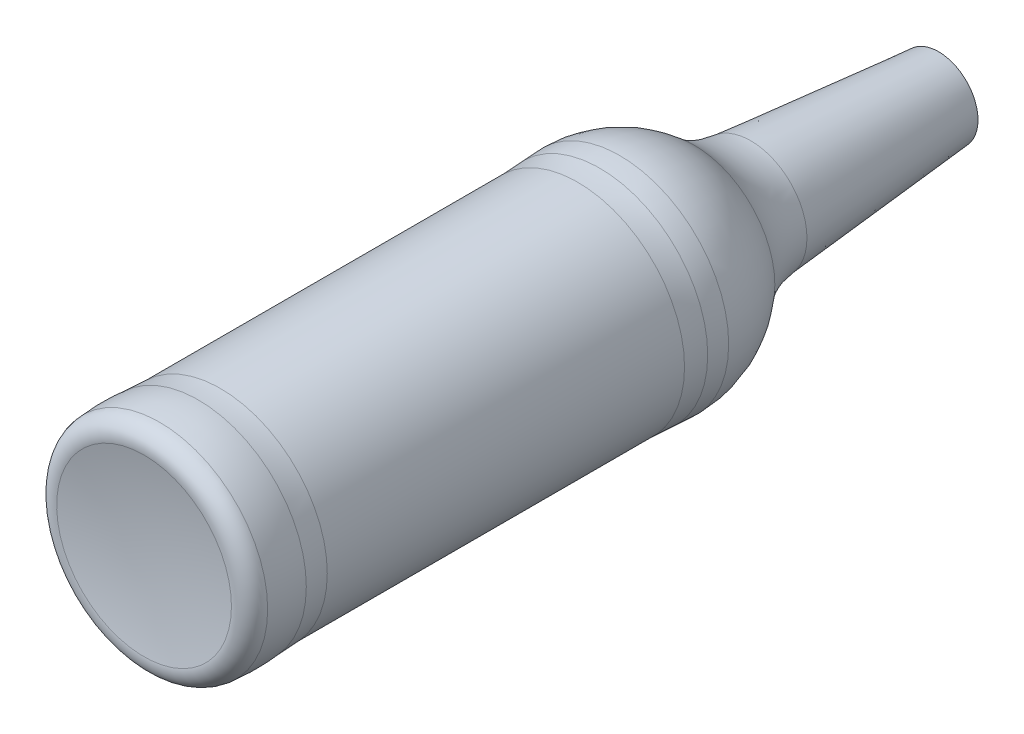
ISO-10303-21;
HEADER;
FILE_DESCRIPTION(('STEP AP214'),'2;1');
FILE_NAME('part.step','',(''),(''),'','','');
FILE_SCHEMA(('AUTOMOTIVE_DESIGN { 1 0 10303 214 1 1 1 1 }'));
ENDSEC;
DATA;
#1=APPLICATION_CONTEXT('core data for automotive mechanical design processes');
#2=APPLICATION_PROTOCOL_DEFINITION('international standard','automotive_design',2000,#1);
#3=PRODUCT_CONTEXT('',#1,'mechanical');
#4=PRODUCT('Part','Part','',(#3));
#5=PRODUCT_RELATED_PRODUCT_CATEGORY('part','',(#4));
#6=PRODUCT_DEFINITION_FORMATION('','',#4);
#7=PRODUCT_DEFINITION_CONTEXT('part definition',#1,'design');
#8=PRODUCT_DEFINITION('design','',#6,#7);
#9=PRODUCT_DEFINITION_SHAPE('','',#8);
#10=(LENGTH_UNIT() NAMED_UNIT(*) SI_UNIT(.MILLI.,.METRE.));
#11=(NAMED_UNIT(*) PLANE_ANGLE_UNIT() SI_UNIT($,.RADIAN.));
#12=(NAMED_UNIT(*) SI_UNIT($,.STERADIAN.) SOLID_ANGLE_UNIT());
#13=UNCERTAINTY_MEASURE_WITH_UNIT(LENGTH_MEASURE(1.E-05),#10,'distance_accuracy_value','');
#14=(GEOMETRIC_REPRESENTATION_CONTEXT(3) GLOBAL_UNCERTAINTY_ASSIGNED_CONTEXT((#13)) GLOBAL_UNIT_ASSIGNED_CONTEXT((#10,
#11,#12)) REPRESENTATION_CONTEXT('',''));
#15=CARTESIAN_POINT('',(0.,0.,0.));
#16=DIRECTION('',(0.,0.,1.));
#17=DIRECTION('',(1.,0.,0.));
#18=AXIS2_PLACEMENT_3D('',#15,#16,#17);
#19=CARTESIAN_POINT('',(0.,0.,399.211089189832));
#20=DIRECTION('',(0.,0.,1.));
#21=DIRECTION('',(0.,1.,0.));
#22=AXIS2_PLACEMENT_3D('',#19,#20,#21);
#23=SPHERICAL_SURFACE('',#22,135.711089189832);
#24=CARTESIAN_POINT('',(0.,0.,265.813116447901));
#25=DIRECTION('',(0.,0.,1.));
#26=DIRECTION('',(1.,0.,0.));
#27=AXIS2_PLACEMENT_3D('',#24,#25,#26);
#28=CIRCLE('',#27,24.9495610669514);
#29=CARTESIAN_POINT('',(24.9495610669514,0.,265.813116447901));
#30=VERTEX_POINT('',#29);
#31=EDGE_CURVE('E82',#30,#30,#28,.T.);
#32=ORIENTED_EDGE('',*,*,#31,.T.);
#33=EDGE_LOOP('',(#32));
#34=FACE_BOUND('',#33,.T.);
#35=ADVANCED_FACE('F38',(#34),#23,.F.);
#36=CARTESIAN_POINT('',(0.,0.,260.898338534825));
#37=DIRECTION('',(0.,0.,1.));
#38=DIRECTION('',(1.,0.,0.));
#39=AXIS2_PLACEMENT_3D('',#36,#37,#38);
#40=TOROIDAL_SURFACE('',#39,25.868777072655,4.99999999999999);
#41=CARTESIAN_POINT('',(0.,0.,261.369332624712));
#42=DIRECTION('',(0.,0.,1.));
#43=DIRECTION('',(1.,0.,0.));
#44=AXIS2_PLACEMENT_3D('',#41,#42,#43);
#45=CIRCLE('',#44,30.8465440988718);
#46=CARTESIAN_POINT('',(30.8465440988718,0.,261.369332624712));
#47=VERTEX_POINT('',#46);
#48=EDGE_CURVE('E78',#47,#47,#45,.T.);
#49=ORIENTED_EDGE('',*,*,#48,.T.);
#50=EDGE_LOOP('',(#49));
#51=FACE_BOUND('',#50,.T.);
#52=ORIENTED_EDGE('',*,*,#31,.F.);
#53=EDGE_LOOP('',(#52));
#54=FACE_BOUND('',#53,.T.);
#55=ADVANCED_FACE('F88',(#51,#54),#40,.T.);
#56=CARTESIAN_POINT('',(0.,0.,256.));
#57=DIRECTION('',(0.,0.,1.));
#58=DIRECTION('',(1.,0.,0.));
#59=AXIS2_PLACEMENT_3D('',#56,#57,#58);
#60=DEGENERATE_TOROIDAL_SURFACE('',#59,25.9,57.,.F.);
#61=CARTESIAN_POINT('',(0.,0.,250.29999999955));
#62=DIRECTION('',(0.,0.,1.));
#63=DIRECTION('',(1.,0.,0.));
#64=AXIS2_PLACEMENT_3D('',#61,#62,#63);
#65=CIRCLE('',#64,30.8142839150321);
#66=CARTESIAN_POINT('',(30.8142839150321,0.,250.29999999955));
#67=VERTEX_POINT('',#66);
#68=EDGE_CURVE('E74',#67,#67,#65,.T.);
#69=ORIENTED_EDGE('',*,*,#68,.T.);
#70=EDGE_LOOP('',(#69));
#71=FACE_BOUND('',#70,.T.);
#72=ORIENTED_EDGE('',*,*,#48,.F.);
#73=EDGE_LOOP('',(#72));
#74=FACE_BOUND('',#73,.T.);
#75=ADVANCED_FACE('F90',(#71,#74),#60,.F.);
#76=CARTESIAN_POINT('',(0.,0.,243.999999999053));
#77=DIRECTION('',(0.,0.,1.));
#78=DIRECTION('',(1.,0.,0.));
#79=AXIS2_PLACEMENT_3D('',#76,#77,#78);
#80=TOROIDAL_SURFACE('',#79,93.4984924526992,63.);
#81=CARTESIAN_POINT('',(0.,0.,243.999999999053));
#82=DIRECTION('',(0.,0.,1.));
#83=DIRECTION('',(1.,0.,0.));
#84=AXIS2_PLACEMENT_3D('',#81,#82,#83);
#85=CIRCLE('',#84,30.4984924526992);
#86=CARTESIAN_POINT('',(30.4984924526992,0.,243.999999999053));
#87=VERTEX_POINT('',#86);
#88=EDGE_CURVE('E70',#87,#87,#85,.T.);
#89=ORIENTED_EDGE('',*,*,#88,.T.);
#90=EDGE_LOOP('',(#89));
#91=FACE_BOUND('',#90,.T.);
#92=ORIENTED_EDGE('',*,*,#68,.F.);
#93=EDGE_LOOP('',(#92));
#94=FACE_BOUND('',#93,.T.);
#95=ADVANCED_FACE('F97',(#91,#94),#80,.F.);
#96=CARTESIAN_POINT('',(0.,0.,270.));
#97=DIRECTION('',(0.,0.,1.));
#98=DIRECTION('',(1.,0.,0.));
#99=AXIS2_PLACEMENT_3D('',#96,#97,#98);
#100=CYLINDRICAL_SURFACE('',#99,30.4984924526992);
#101=CARTESIAN_POINT('',(0.,0.,142.));
#102=DIRECTION('',(0.,0.,1.));
#103=DIRECTION('',(1.,0.,0.));
#104=AXIS2_PLACEMENT_3D('',#101,#102,#103);
#105=CIRCLE('',#104,30.4984924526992);
#106=CARTESIAN_POINT('',(30.4984924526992,0.,142.));
#107=VERTEX_POINT('',#106);
#108=EDGE_CURVE('E66',#107,#107,#105,.T.);
#109=ORIENTED_EDGE('',*,*,#108,.T.);
#110=EDGE_LOOP('',(#109));
#111=FACE_BOUND('',#110,.T.);
#112=ORIENTED_EDGE('',*,*,#88,.F.);
#113=EDGE_LOOP('',(#112));
#114=FACE_BOUND('',#113,.T.);
#115=ADVANCED_FACE('F105',(#111,#114),#100,.T.);
#116=CARTESIAN_POINT('',(0.,0.,142.));
#117=DIRECTION('',(0.,0.,1.));
#118=DIRECTION('',(1.,0.,0.));
#119=AXIS2_PLACEMENT_3D('',#116,#117,#118);
#120=TOROIDAL_SURFACE('',#119,93.4984924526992,63.);
#121=CARTESIAN_POINT('',(0.,0.,135.7));
#122=DIRECTION('',(0.,0.,1.));
#123=DIRECTION('',(1.,0.,0.));
#124=AXIS2_PLACEMENT_3D('',#121,#122,#123);
#125=CIRCLE('',#124,30.8142839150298);
#126=CARTESIAN_POINT('',(30.8142839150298,0.,135.7));
#127=VERTEX_POINT('',#126);
#128=EDGE_CURVE('E62',#127,#127,#125,.T.);
#129=ORIENTED_EDGE('',*,*,#128,.T.);
#130=EDGE_LOOP('',(#129));
#131=FACE_BOUND('',#130,.T.);
#132=ORIENTED_EDGE('',*,*,#108,.F.);
#133=EDGE_LOOP('',(#132));
#134=FACE_BOUND('',#133,.T.);
#135=ADVANCED_FACE('F109',(#131,#134),#120,.F.);
#136=CARTESIAN_POINT('',(0.,0.,130.));
#137=DIRECTION('',(0.,0.,1.));
#138=DIRECTION('',(1.,0.,0.));
#139=AXIS2_PLACEMENT_3D('',#136,#137,#138);
#140=DEGENERATE_TOROIDAL_SURFACE('',#139,25.9,56.9999999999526,.F.);
#141=CARTESIAN_POINT('',(0.,0.,130.));
#142=DIRECTION('',(0.,0.,1.));
#143=DIRECTION('',(1.,0.,0.));
#144=AXIS2_PLACEMENT_3D('',#141,#142,#143);
#145=CIRCLE('',#144,31.1);
#146=CARTESIAN_POINT('',(31.1,0.,130.));
#147=VERTEX_POINT('',#146);
#148=EDGE_CURVE('E56',#147,#147,#145,.T.);
#149=ORIENTED_EDGE('',*,*,#148,.T.);
#150=EDGE_LOOP('',(#149));
#151=FACE_BOUND('',#150,.T.);
#152=ORIENTED_EDGE('',*,*,#128,.F.);
#153=EDGE_LOOP('',(#152));
#154=FACE_BOUND('',#153,.T.);
#155=ADVANCED_FACE('F113',(#151,#154),#140,.F.);
#156=CARTESIAN_POINT('',(0.,0.,130.));
#157=DIRECTION('',(0.,0.,1.));
#158=DIRECTION('',(1.,0.,0.));
#159=AXIS2_PLACEMENT_3D('',#156,#157,#158);
#160=DEGENERATE_TOROIDAL_SURFACE('',#159,0.900000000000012,32.,.F.);
#161=CARTESIAN_POINT('',(0.,0.,108.726737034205));
#162=DIRECTION('',(0.,0.,1.));
#163=DIRECTION('',(1.,0.,0.));
#164=AXIS2_PLACEMENT_3D('',#161,#162,#163);
#165=CIRCLE('',#164,23.0049844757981);
#166=CARTESIAN_POINT('',(23.0049844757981,0.,108.726737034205));
#167=VERTEX_POINT('',#166);
#168=EDGE_CURVE('E51',#167,#167,#165,.T.);
#169=ORIENTED_EDGE('',*,*,#168,.T.);
#170=EDGE_LOOP('',(#169));
#171=FACE_BOUND('',#170,.T.);
#172=ORIENTED_EDGE('',*,*,#148,.F.);
#173=EDGE_LOOP('',(#172));
#174=FACE_BOUND('',#173,.T.);
#175=ADVANCED_FACE('F117',(#171,#174),#160,.F.);
#176=CARTESIAN_POINT('',(0.,0.,90.112631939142));
#177=DIRECTION('',(0.,0.,1.));
#178=DIRECTION('',(1.,0.,0.));
#179=AXIS2_PLACEMENT_3D('',#176,#177,#178);
#180=TOROIDAL_SURFACE('',#179,43.9218458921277,28.);
#181=CARTESIAN_POINT('',(0.,0.,92.5868847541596));
#182=DIRECTION('',(0.,0.,1.));
#183=DIRECTION('',(1.,0.,0.));
#184=AXIS2_PLACEMENT_3D('',#181,#182,#183);
#185=CIRCLE('',#184,16.031380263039);
#186=CARTESIAN_POINT('',(16.031380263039,0.,92.5868847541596));
#187=VERTEX_POINT('',#186);
#188=EDGE_CURVE('E46',#187,#187,#185,.T.);
#189=ORIENTED_EDGE('',*,*,#188,.T.);
#190=EDGE_LOOP('',(#189));
#191=FACE_BOUND('',#190,.T.);
#192=ORIENTED_EDGE('',*,*,#168,.F.);
#193=EDGE_LOOP('',(#192));
#194=FACE_BOUND('',#193,.T.);
#195=ADVANCED_FACE('F120',(#191,#194),#180,.F.);
#196=CARTESIAN_POINT('',(0.,0.,92.5868847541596));
#197=DIRECTION('',(0.,0.,1.));
#198=DIRECTION('',(1.,0.,0.));
#199=AXIS2_PLACEMENT_3D('',#196,#197,#198);
#200=CONICAL_SURFACE('',#199,16.031380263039,0.0884815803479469);
#201=CARTESIAN_POINT('',(0.,0.,39.));
#202=DIRECTION('',(0.,0.,1.));
#203=DIRECTION('',(1.,0.,0.));
#204=AXIS2_PLACEMENT_3D('',#201,#202,#203);
#205=CIRCLE('',#204,11.2775155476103);
#206=CARTESIAN_POINT('',(11.2775155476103,0.,39.));
#207=VERTEX_POINT('',#206);
#208=EDGE_CURVE('E10',#207,#207,#205,.F.);
#209=ORIENTED_EDGE('',*,*,#208,.F.);
#210=EDGE_LOOP('',(#209));
#211=FACE_BOUND('',#210,.T.);
#212=ORIENTED_EDGE('',*,*,#188,.F.);
#213=EDGE_LOOP('',(#212));
#214=FACE_BOUND('',#213,.T.);
#215=ADVANCED_FACE('F40',(#211,#214),#200,.T.);
#216=CARTESIAN_POINT('',(-31.1,-11.2775155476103,39.));
#217=DIRECTION('',(0.,0.,1.));
#218=DIRECTION('',(1.,0.,0.));
#219=AXIS2_PLACEMENT_3D('',#216,#217,#218);
#220=PLANE('',#219);
#221=ORIENTED_EDGE('',*,*,#208,.T.);
#222=EDGE_LOOP('',(#221));
#223=FACE_BOUND('',#222,.T.);
#224=ADVANCED_FACE('F126',(#223),#220,.F.);
#225=CLOSED_SHELL('',(#35,#55,#75,#95,#115,#135,#155,#175,#195,#215,#224));
#226=MANIFOLD_SOLID_BREP('B2',#225);
#227=ADVANCED_BREP_SHAPE_REPRESENTATION('',(#18,#226),#14);
#228=SHAPE_DEFINITION_REPRESENTATION(#9,#227);
ENDSEC;
END-ISO-10303-21;
